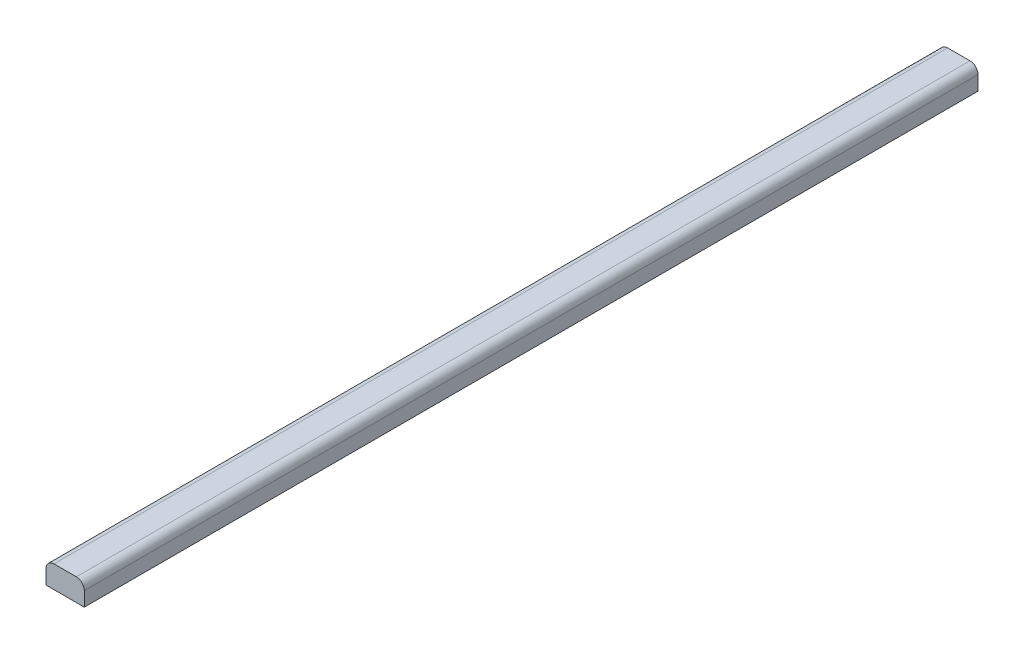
ISO-10303-21;
HEADER;
FILE_DESCRIPTION(('STEP AP214'),'2;1');
FILE_NAME('part.step','',(''),(''),'','','');
FILE_SCHEMA(('AUTOMOTIVE_DESIGN { 1 0 10303 214 1 1 1 1 }'));
ENDSEC;
DATA;
#1=APPLICATION_CONTEXT('core data for automotive mechanical design processes');
#2=APPLICATION_PROTOCOL_DEFINITION('international standard','automotive_design',2000,#1);
#3=PRODUCT_CONTEXT('',#1,'mechanical');
#4=PRODUCT('Part','Part','',(#3));
#5=PRODUCT_RELATED_PRODUCT_CATEGORY('part','',(#4));
#6=PRODUCT_DEFINITION_FORMATION('','',#4);
#7=PRODUCT_DEFINITION_CONTEXT('part definition',#1,'design');
#8=PRODUCT_DEFINITION('design','',#6,#7);
#9=PRODUCT_DEFINITION_SHAPE('','',#8);
#10=(LENGTH_UNIT() NAMED_UNIT(*) SI_UNIT(.MILLI.,.METRE.));
#11=(NAMED_UNIT(*) PLANE_ANGLE_UNIT() SI_UNIT($,.RADIAN.));
#12=(NAMED_UNIT(*) SI_UNIT($,.STERADIAN.) SOLID_ANGLE_UNIT());
#13=UNCERTAINTY_MEASURE_WITH_UNIT(LENGTH_MEASURE(1.E-05),#10,'distance_accuracy_value','');
#14=(GEOMETRIC_REPRESENTATION_CONTEXT(3) GLOBAL_UNCERTAINTY_ASSIGNED_CONTEXT((#13)) GLOBAL_UNIT_ASSIGNED_CONTEXT((#10,
#11,#12)) REPRESENTATION_CONTEXT('',''));
#15=CARTESIAN_POINT('',(0.,0.,0.));
#16=DIRECTION('',(0.,0.,1.));
#17=DIRECTION('',(1.,0.,0.));
#18=AXIS2_PLACEMENT_3D('',#15,#16,#17);
#19=CARTESIAN_POINT('',(-2816.80264879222,0.,560.));
#20=DIRECTION('',(1.,0.,0.));
#21=DIRECTION('',(0.,0.,-1.));
#22=AXIS2_PLACEMENT_3D('',#19,#20,#21);
#23=PLANE('',#22);
#24=DIRECTION('',(0.,-1.,0.));
#25=VECTOR('',#24,1.);
#26=CARTESIAN_POINT('',(-2816.80264879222,0.,0.));
#27=LINE('',#26,#25);
#28=CARTESIAN_POINT('',(-2816.80264879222,92.0000700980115,0.));
#29=VERTEX_POINT('',#28);
#30=CARTESIAN_POINT('',(-2816.80264879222,83.0000700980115,0.));
#31=VERTEX_POINT('',#30);
#32=EDGE_CURVE('E161',#29,#31,#27,.T.);
#33=ORIENTED_EDGE('',*,*,#32,.F.);
#34=DIRECTION('',(0.,0.,-1.));
#35=VECTOR('',#34,1.);
#36=CARTESIAN_POINT('',(-2816.80264879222,92.0000700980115,560.));
#37=LINE('',#36,#35);
#38=CARTESIAN_POINT('',(-2816.80264879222,92.0000700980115,560.));
#39=VERTEX_POINT('',#38);
#40=EDGE_CURVE('E109',#39,#29,#37,.T.);
#41=ORIENTED_EDGE('',*,*,#40,.F.);
#42=DIRECTION('',(0.,-1.,0.));
#43=VECTOR('',#42,1.);
#44=CARTESIAN_POINT('',(-2816.80264879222,0.,560.));
#45=LINE('',#44,#43);
#46=CARTESIAN_POINT('',(-2816.80264879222,83.0000700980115,560.));
#47=VERTEX_POINT('',#46);
#48=EDGE_CURVE('E142',#39,#47,#45,.T.);
#49=ORIENTED_EDGE('',*,*,#48,.T.);
#50=DIRECTION('',(0.,0.,-1.));
#51=VECTOR('',#50,1.);
#52=CARTESIAN_POINT('',(-2816.80264879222,83.0000700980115,560.));
#53=LINE('',#52,#51);
#54=EDGE_CURVE('E129',#47,#31,#53,.T.);
#55=ORIENTED_EDGE('',*,*,#54,.T.);
#56=EDGE_LOOP('',(#33,#41,#49,#55));
#57=FACE_BOUND('',#56,.T.);
#58=ADVANCED_FACE('F70',(#57),#23,.T.);
#59=CARTESIAN_POINT('',(0.,0.,0.));
#60=DIRECTION('',(0.,0.,1.));
#61=DIRECTION('',(1.,0.,0.));
#62=AXIS2_PLACEMENT_3D('',#59,#60,#61);
#63=PLANE('',#62);
#64=DIRECTION('',(-1.,0.,0.));
#65=VECTOR('',#64,1.);
#66=CARTESIAN_POINT('',(0.,97.0000700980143,0.));
#67=LINE('',#66,#65);
#68=CARTESIAN_POINT('',(-2821.80264879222,97.0000700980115,0.));
#69=VERTEX_POINT('',#68);
#70=CARTESIAN_POINT('',(-2835.80264879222,97.0000700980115,0.));
#71=VERTEX_POINT('',#70);
#72=EDGE_CURVE('E152',#69,#71,#67,.T.);
#73=ORIENTED_EDGE('',*,*,#72,.F.);
#74=CARTESIAN_POINT('',(-2821.80264879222,92.0000700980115,0.));
#75=DIRECTION('',(0.,0.,1.));
#76=DIRECTION('',(1.,0.,0.));
#77=AXIS2_PLACEMENT_3D('',#74,#75,#76);
#78=CIRCLE('',#77,5.00000000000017);
#79=EDGE_CURVE('E112',#29,#69,#78,.T.);
#80=ORIENTED_EDGE('',*,*,#79,.F.);
#81=ORIENTED_EDGE('',*,*,#32,.T.);
#82=DIRECTION('',(-1.,0.,0.));
#83=VECTOR('',#82,1.);
#84=CARTESIAN_POINT('',(0.,83.0000700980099,0.));
#85=LINE('',#84,#83);
#86=CARTESIAN_POINT('',(-2840.80264879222,83.0000700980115,0.));
#87=VERTEX_POINT('',#86);
#88=EDGE_CURVE('E134',#31,#87,#85,.T.);
#89=ORIENTED_EDGE('',*,*,#88,.T.);
#90=DIRECTION('',(0.,-1.,0.));
#91=VECTOR('',#90,1.);
#92=CARTESIAN_POINT('',(-2840.80264879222,0.,0.));
#93=LINE('',#92,#91);
#94=CARTESIAN_POINT('',(-2840.80264879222,92.0000700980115,0.));
#95=VERTEX_POINT('',#94);
#96=EDGE_CURVE('E157',#95,#87,#93,.T.);
#97=ORIENTED_EDGE('',*,*,#96,.F.);
#98=CARTESIAN_POINT('',(-2835.80264879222,92.0000700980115,0.));
#99=DIRECTION('',(0.,0.,1.));
#100=DIRECTION('',(1.,0.,0.));
#101=AXIS2_PLACEMENT_3D('',#98,#99,#100);
#102=CIRCLE('',#101,4.99999999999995);
#103=EDGE_CURVE('E155',#71,#95,#102,.T.);
#104=ORIENTED_EDGE('',*,*,#103,.F.);
#105=EDGE_LOOP('',(#73,#80,#81,#89,#97,#104));
#106=FACE_BOUND('',#105,.T.);
#107=ADVANCED_FACE('F173',(#106),#63,.F.);
#108=CARTESIAN_POINT('',(0.,83.0000700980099,560.));
#109=DIRECTION('',(0.,-1.,0.));
#110=DIRECTION('',(1.,0.,0.));
#111=AXIS2_PLACEMENT_3D('',#108,#109,#110);
#112=PLANE('',#111);
#113=ORIENTED_EDGE('',*,*,#88,.F.);
#114=ORIENTED_EDGE('',*,*,#54,.F.);
#115=DIRECTION('',(-1.,0.,0.));
#116=VECTOR('',#115,1.);
#117=CARTESIAN_POINT('',(0.,83.0000700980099,560.));
#118=LINE('',#117,#116);
#119=CARTESIAN_POINT('',(-2840.80264879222,83.0000700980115,560.));
#120=VERTEX_POINT('',#119);
#121=EDGE_CURVE('E132',#47,#120,#118,.T.);
#122=ORIENTED_EDGE('',*,*,#121,.T.);
#123=DIRECTION('',(0.,0.,-1.));
#124=VECTOR('',#123,1.);
#125=CARTESIAN_POINT('',(-2840.80264879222,83.0000700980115,560.));
#126=LINE('',#125,#124);
#127=EDGE_CURVE('E139',#120,#87,#126,.T.);
#128=ORIENTED_EDGE('',*,*,#127,.T.);
#129=EDGE_LOOP('',(#113,#114,#122,#128));
#130=FACE_BOUND('',#129,.T.);
#131=ADVANCED_FACE('F131',(#130),#112,.T.);
#132=CARTESIAN_POINT('',(-2840.80264879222,0.,560.));
#133=DIRECTION('',(1.,0.,0.));
#134=DIRECTION('',(0.,0.,-1.));
#135=AXIS2_PLACEMENT_3D('',#132,#133,#134);
#136=PLANE('',#135);
#137=ORIENTED_EDGE('',*,*,#96,.T.);
#138=ORIENTED_EDGE('',*,*,#127,.F.);
#139=DIRECTION('',(0.,-1.,0.));
#140=VECTOR('',#139,1.);
#141=CARTESIAN_POINT('',(-2840.80264879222,0.,560.));
#142=LINE('',#141,#140);
#143=CARTESIAN_POINT('',(-2840.80264879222,92.0000700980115,560.));
#144=VERTEX_POINT('',#143);
#145=EDGE_CURVE('E144',#144,#120,#142,.T.);
#146=ORIENTED_EDGE('',*,*,#145,.F.);
#147=DIRECTION('',(0.,0.,-1.));
#148=VECTOR('',#147,1.);
#149=CARTESIAN_POINT('',(-2840.80264879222,92.0000700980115,560.));
#150=LINE('',#149,#148);
#151=EDGE_CURVE('E79',#144,#95,#150,.T.);
#152=ORIENTED_EDGE('',*,*,#151,.T.);
#153=EDGE_LOOP('',(#137,#138,#146,#152));
#154=FACE_BOUND('',#153,.T.);
#155=ADVANCED_FACE('F170',(#154),#136,.F.);
#156=CARTESIAN_POINT('',(-2835.80264879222,92.0000700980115,560.));
#157=DIRECTION('',(0.,0.,-1.));
#158=DIRECTION('',(-1.,0.,0.));
#159=AXIS2_PLACEMENT_3D('',#156,#157,#158);
#160=CYLINDRICAL_SURFACE('',#159,4.99999999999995);
#161=ORIENTED_EDGE('',*,*,#103,.T.);
#162=ORIENTED_EDGE('',*,*,#151,.F.);
#163=CARTESIAN_POINT('',(-2835.80264879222,92.0000700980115,560.));
#164=DIRECTION('',(0.,0.,1.));
#165=DIRECTION('',(1.,0.,0.));
#166=AXIS2_PLACEMENT_3D('',#163,#164,#165);
#167=CIRCLE('',#166,4.99999999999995);
#168=CARTESIAN_POINT('',(-2835.80264879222,97.0000700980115,560.));
#169=VERTEX_POINT('',#168);
#170=EDGE_CURVE('E120',#169,#144,#167,.T.);
#171=ORIENTED_EDGE('',*,*,#170,.F.);
#172=DIRECTION('',(0.,0.,-1.));
#173=VECTOR('',#172,1.);
#174=CARTESIAN_POINT('',(-2835.80264879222,97.0000700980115,560.));
#175=LINE('',#174,#173);
#176=EDGE_CURVE('E12',#169,#71,#175,.T.);
#177=ORIENTED_EDGE('',*,*,#176,.T.);
#178=EDGE_LOOP('',(#161,#162,#171,#177));
#179=FACE_BOUND('',#178,.T.);
#180=ADVANCED_FACE('F185',(#179),#160,.T.);
#181=CARTESIAN_POINT('',(0.,97.0000700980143,560.));
#182=DIRECTION('',(0.,-1.,0.));
#183=DIRECTION('',(1.,0.,0.));
#184=AXIS2_PLACEMENT_3D('',#181,#182,#183);
#185=PLANE('',#184);
#186=ORIENTED_EDGE('',*,*,#72,.T.);
#187=ORIENTED_EDGE('',*,*,#176,.F.);
#188=DIRECTION('',(-1.,0.,0.));
#189=VECTOR('',#188,1.);
#190=CARTESIAN_POINT('',(0.,97.0000700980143,560.));
#191=LINE('',#190,#189);
#192=CARTESIAN_POINT('',(-2821.80264879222,97.0000700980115,560.));
#193=VERTEX_POINT('',#192);
#194=EDGE_CURVE('E164',#193,#169,#191,.T.);
#195=ORIENTED_EDGE('',*,*,#194,.F.);
#196=DIRECTION('',(0.,0.,-1.));
#197=VECTOR('',#196,1.);
#198=CARTESIAN_POINT('',(-2821.80264879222,97.0000700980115,560.));
#199=LINE('',#198,#197);
#200=EDGE_CURVE('E148',#193,#69,#199,.T.);
#201=ORIENTED_EDGE('',*,*,#200,.T.);
#202=EDGE_LOOP('',(#186,#187,#195,#201));
#203=FACE_BOUND('',#202,.T.);
#204=ADVANCED_FACE('F72',(#203),#185,.F.);
#205=CARTESIAN_POINT('',(-2821.80264879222,92.0000700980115,560.));
#206=DIRECTION('',(0.,0.,-1.));
#207=DIRECTION('',(-1.,0.,0.));
#208=AXIS2_PLACEMENT_3D('',#205,#206,#207);
#209=CYLINDRICAL_SURFACE('',#208,5.00000000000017);
#210=ORIENTED_EDGE('',*,*,#79,.T.);
#211=ORIENTED_EDGE('',*,*,#200,.F.);
#212=CARTESIAN_POINT('',(-2821.80264879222,92.0000700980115,560.));
#213=DIRECTION('',(0.,0.,1.));
#214=DIRECTION('',(1.,0.,0.));
#215=AXIS2_PLACEMENT_3D('',#212,#213,#214);
#216=CIRCLE('',#215,5.00000000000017);
#217=EDGE_CURVE('E87',#39,#193,#216,.T.);
#218=ORIENTED_EDGE('',*,*,#217,.F.);
#219=ORIENTED_EDGE('',*,*,#40,.T.);
#220=EDGE_LOOP('',(#210,#211,#218,#219));
#221=FACE_BOUND('',#220,.T.);
#222=ADVANCED_FACE('F177',(#221),#209,.T.);
#223=CARTESIAN_POINT('',(0.,0.,560.));
#224=DIRECTION('',(0.,0.,1.));
#225=DIRECTION('',(1.,0.,0.));
#226=AXIS2_PLACEMENT_3D('',#223,#224,#225);
#227=PLANE('',#226);
#228=ORIENTED_EDGE('',*,*,#194,.T.);
#229=ORIENTED_EDGE('',*,*,#170,.T.);
#230=ORIENTED_EDGE('',*,*,#145,.T.);
#231=ORIENTED_EDGE('',*,*,#121,.F.);
#232=ORIENTED_EDGE('',*,*,#48,.F.);
#233=ORIENTED_EDGE('',*,*,#217,.T.);
#234=EDGE_LOOP('',(#228,#229,#230,#231,#232,#233));
#235=FACE_BOUND('',#234,.T.);
#236=ADVANCED_FACE('F141',(#235),#227,.T.);
#237=CLOSED_SHELL('',(#58,#107,#131,#155,#180,#204,#222,#236));
#238=MANIFOLD_SOLID_BREP('B2',#237);
#239=ADVANCED_BREP_SHAPE_REPRESENTATION('',(#18,#238),#14);
#240=SHAPE_DEFINITION_REPRESENTATION(#9,#239);
ENDSEC;
END-ISO-10303-21;
